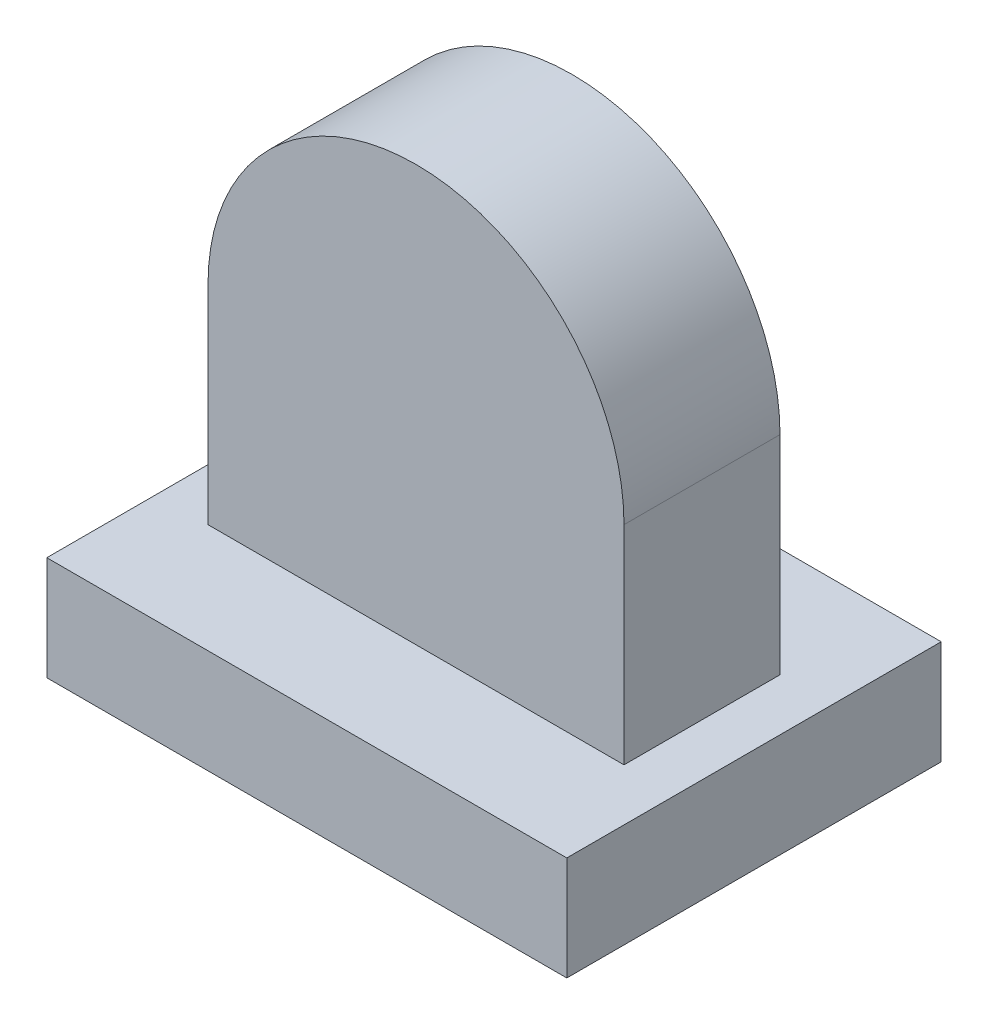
from build123d import *

# Parameters (mm, degrees)
SKETCH_1_W      = 50
SKETCH_1_H      = 36
EXTRUDE_1_DEPTH = 10
EXTRUDE_2_DEPTH = 7.5


with BuildPart() as part:
    # Sketch 1 → Extrude 1 (new body)
    with BuildSketch(Plane(origin=(0, 0, 0), x_dir=(1, 0, 0), z_dir=(0, 1, 0))):
        Rectangle(SKETCH_1_W, SKETCH_1_H)
    extrude(amount=EXTRUDE_1_DEPTH)

    # Sketch 3 → Extrude 2 (add, symmetric)
    with BuildSketch(Plane.XY):
        with BuildLine():
            Line((20, 30), (20, 10))
            Line((20, 10), (-20, 10))
            Line((-20, 10), (-20, 30))
            ThreePointArc((-20, 30), (0, 50), (20, 30))
        make_face()
    extrude(amount=EXTRUDE_2_DEPTH, both=True)


solid = part.part
